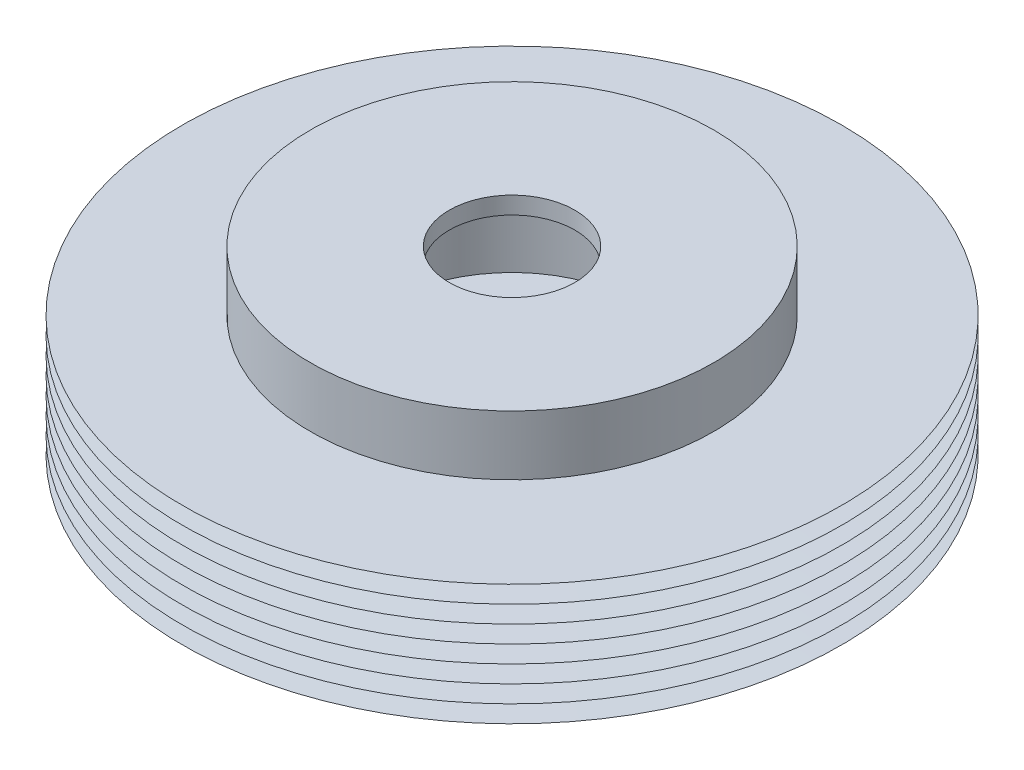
ISO-10303-21;
HEADER;
FILE_DESCRIPTION(('STEP AP214'),'2;1');
FILE_NAME('part.step','',(''),(''),'','','');
FILE_SCHEMA(('AUTOMOTIVE_DESIGN { 1 0 10303 214 1 1 1 1 }'));
ENDSEC;
DATA;
#1=APPLICATION_CONTEXT('core data for automotive mechanical design processes');
#2=APPLICATION_PROTOCOL_DEFINITION('international standard','automotive_design',2000,#1);
#3=PRODUCT_CONTEXT('',#1,'mechanical');
#4=PRODUCT('Part','Part','',(#3));
#5=PRODUCT_RELATED_PRODUCT_CATEGORY('part','',(#4));
#6=PRODUCT_DEFINITION_FORMATION('','',#4);
#7=PRODUCT_DEFINITION_CONTEXT('part definition',#1,'design');
#8=PRODUCT_DEFINITION('design','',#6,#7);
#9=PRODUCT_DEFINITION_SHAPE('','',#8);
#10=(LENGTH_UNIT() NAMED_UNIT(*) SI_UNIT(.MILLI.,.METRE.));
#11=(NAMED_UNIT(*) PLANE_ANGLE_UNIT() SI_UNIT($,.RADIAN.));
#12=(NAMED_UNIT(*) SI_UNIT($,.STERADIAN.) SOLID_ANGLE_UNIT());
#13=UNCERTAINTY_MEASURE_WITH_UNIT(LENGTH_MEASURE(1.E-05),#10,'distance_accuracy_value','');
#14=(GEOMETRIC_REPRESENTATION_CONTEXT(3) GLOBAL_UNCERTAINTY_ASSIGNED_CONTEXT((#13)) GLOBAL_UNIT_ASSIGNED_CONTEXT((#10,
#11,#12)) REPRESENTATION_CONTEXT('',''));
#15=CARTESIAN_POINT('',(0.,0.,0.));
#16=DIRECTION('',(0.,0.,1.));
#17=DIRECTION('',(1.,0.,0.));
#18=AXIS2_PLACEMENT_3D('',#15,#16,#17);
#19=CARTESIAN_POINT('',(8.,4.4,0.));
#20=DIRECTION('',(0.,1.,0.));
#21=DIRECTION('',(1.,0.,0.));
#22=AXIS2_PLACEMENT_3D('',#19,#20,#21);
#23=PLANE('',#22);
#24=CARTESIAN_POINT('',(0.,4.4,0.));
#25=DIRECTION('',(0.,-1.,0.));
#26=DIRECTION('',(0.,0.,-1.));
#27=AXIS2_PLACEMENT_3D('',#24,#25,#26);
#28=CIRCLE('',#27,4.);
#29=CARTESIAN_POINT('',(0.,4.4,-4.));
#30=VERTEX_POINT('',#29);
#31=EDGE_CURVE('E11',#30,#30,#28,.T.);
#32=ORIENTED_EDGE('',*,*,#31,.T.);
#33=EDGE_LOOP('',(#32));
#34=FACE_BOUND('',#33,.T.);
#35=CARTESIAN_POINT('',(0.,4.4,0.));
#36=DIRECTION('',(0.,-1.,0.));
#37=DIRECTION('',(0.,0.,-1.));
#38=AXIS2_PLACEMENT_3D('',#35,#36,#37);
#39=CIRCLE('',#38,8.);
#40=CARTESIAN_POINT('',(0.,4.4,-8.));
#41=VERTEX_POINT('',#40);
#42=EDGE_CURVE('E20',#41,#41,#39,.T.);
#43=ORIENTED_EDGE('',*,*,#42,.F.);
#44=EDGE_LOOP('',(#43));
#45=FACE_BOUND('',#44,.T.);
#46=ADVANCED_FACE('F16',(#34,#45),#23,.T.);
#47=CARTESIAN_POINT('',(0.,0.,0.));
#48=DIRECTION('',(0.,-1.,0.));
#49=DIRECTION('',(0.,0.,-1.));
#50=AXIS2_PLACEMENT_3D('',#47,#48,#49);
#51=CYLINDRICAL_SURFACE('',#50,4.);
#52=CARTESIAN_POINT('',(0.,0.,0.));
#53=DIRECTION('',(0.,-1.,0.));
#54=DIRECTION('',(0.,0.,-1.));
#55=AXIS2_PLACEMENT_3D('',#52,#53,#54);
#56=CIRCLE('',#55,4.);
#57=CARTESIAN_POINT('',(0.,0.,-4.));
#58=VERTEX_POINT('',#57);
#59=EDGE_CURVE('E27',#58,#58,#56,.T.);
#60=ORIENTED_EDGE('',*,*,#59,.T.);
#61=EDGE_LOOP('',(#60));
#62=FACE_BOUND('',#61,.T.);
#63=ORIENTED_EDGE('',*,*,#31,.F.);
#64=EDGE_LOOP('',(#63));
#65=FACE_BOUND('',#64,.T.);
#66=ADVANCED_FACE('F244',(#62,#65),#51,.F.);
#67=CARTESIAN_POINT('',(4.,0.,0.));
#68=DIRECTION('',(0.,-1.,0.));
#69=DIRECTION('',(0.,0.,-1.));
#70=AXIS2_PLACEMENT_3D('',#67,#68,#69);
#71=PLANE('',#70);
#72=CARTESIAN_POINT('',(0.,0.,0.));
#73=DIRECTION('',(0.,-1.,0.));
#74=DIRECTION('',(0.,0.,-1.));
#75=AXIS2_PLACEMENT_3D('',#72,#73,#74);
#76=CIRCLE('',#75,21.);
#77=CARTESIAN_POINT('',(0.,0.,-21.));
#78=VERTEX_POINT('',#77);
#79=EDGE_CURVE('E88',#78,#78,#76,.T.);
#80=ORIENTED_EDGE('',*,*,#79,.T.);
#81=EDGE_LOOP('',(#80));
#82=FACE_BOUND('',#81,.T.);
#83=ORIENTED_EDGE('',*,*,#59,.F.);
#84=EDGE_LOOP('',(#83));
#85=FACE_BOUND('',#84,.T.);
#86=ADVANCED_FACE('F250',(#82,#85),#71,.T.);
#87=CARTESIAN_POINT('',(0.,0.,0.));
#88=DIRECTION('',(0.,-1.,0.));
#89=DIRECTION('',(0.,0.,-1.));
#90=AXIS2_PLACEMENT_3D('',#87,#88,#89);
#91=CONICAL_SURFACE('',#90,21.,1.52682468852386);
#92=CARTESIAN_POINT('',(0.,0.55,0.));
#93=DIRECTION('',(0.,-1.,0.));
#94=DIRECTION('',(0.,0.,-1.));
#95=AXIS2_PLACEMENT_3D('',#92,#93,#94);
#96=CIRCLE('',#95,8.5);
#97=CARTESIAN_POINT('',(0.,0.55,-8.5));
#98=VERTEX_POINT('',#97);
#99=EDGE_CURVE('E160',#98,#98,#96,.T.);
#100=ORIENTED_EDGE('',*,*,#99,.T.);
#101=EDGE_LOOP('',(#100));
#102=FACE_BOUND('',#101,.T.);
#103=ORIENTED_EDGE('',*,*,#79,.F.);
#104=EDGE_LOOP('',(#103));
#105=FACE_BOUND('',#104,.T.);
#106=ADVANCED_FACE('F278',(#102,#105),#91,.T.);
#107=CARTESIAN_POINT('',(0.,0.55,0.));
#108=DIRECTION('',(0.,1.,0.));
#109=DIRECTION('',(0.,0.,1.));
#110=AXIS2_PLACEMENT_3D('',#107,#108,#109);
#111=CONICAL_SURFACE('',#110,8.5,1.52682468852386);
#112=CARTESIAN_POINT('',(0.,1.1,0.));
#113=DIRECTION('',(0.,-1.,0.));
#114=DIRECTION('',(0.,0.,-1.));
#115=AXIS2_PLACEMENT_3D('',#112,#113,#114);
#116=CIRCLE('',#115,21.);
#117=CARTESIAN_POINT('',(0.,1.1,-21.));
#118=VERTEX_POINT('',#117);
#119=EDGE_CURVE('E164',#118,#118,#116,.T.);
#120=ORIENTED_EDGE('',*,*,#119,.T.);
#121=EDGE_LOOP('',(#120));
#122=FACE_BOUND('',#121,.T.);
#123=ORIENTED_EDGE('',*,*,#99,.F.);
#124=EDGE_LOOP('',(#123));
#125=FACE_BOUND('',#124,.T.);
#126=ADVANCED_FACE('F283',(#122,#125),#111,.T.);
#127=CARTESIAN_POINT('',(0.,1.1,0.));
#128=DIRECTION('',(0.,-1.,0.));
#129=DIRECTION('',(0.,0.,-1.));
#130=AXIS2_PLACEMENT_3D('',#127,#128,#129);
#131=CONICAL_SURFACE('',#130,21.,1.52682468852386);
#132=CARTESIAN_POINT('',(0.,1.65,0.));
#133=DIRECTION('',(0.,-1.,0.));
#134=DIRECTION('',(0.,0.,-1.));
#135=AXIS2_PLACEMENT_3D('',#132,#133,#134);
#136=CIRCLE('',#135,8.5);
#137=CARTESIAN_POINT('',(0.,1.65,-8.5));
#138=VERTEX_POINT('',#137);
#139=EDGE_CURVE('E195',#138,#138,#136,.T.);
#140=ORIENTED_EDGE('',*,*,#139,.T.);
#141=EDGE_LOOP('',(#140));
#142=FACE_BOUND('',#141,.T.);
#143=ORIENTED_EDGE('',*,*,#119,.F.);
#144=EDGE_LOOP('',(#143));
#145=FACE_BOUND('',#144,.T.);
#146=ADVANCED_FACE('F285',(#142,#145),#131,.T.);
#147=CARTESIAN_POINT('',(0.,1.65,0.));
#148=DIRECTION('',(0.,1.,0.));
#149=DIRECTION('',(0.,0.,1.));
#150=AXIS2_PLACEMENT_3D('',#147,#148,#149);
#151=CONICAL_SURFACE('',#150,8.5,1.52682468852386);
#152=CARTESIAN_POINT('',(0.,2.2,0.));
#153=DIRECTION('',(0.,-1.,0.));
#154=DIRECTION('',(0.,0.,-1.));
#155=AXIS2_PLACEMENT_3D('',#152,#153,#154);
#156=CIRCLE('',#155,21.);
#157=CARTESIAN_POINT('',(0.,2.2,-21.));
#158=VERTEX_POINT('',#157);
#159=EDGE_CURVE('E107',#158,#158,#156,.T.);
#160=ORIENTED_EDGE('',*,*,#159,.T.);
#161=EDGE_LOOP('',(#160));
#162=FACE_BOUND('',#161,.T.);
#163=ORIENTED_EDGE('',*,*,#139,.F.);
#164=EDGE_LOOP('',(#163));
#165=FACE_BOUND('',#164,.T.);
#166=ADVANCED_FACE('F292',(#162,#165),#151,.T.);
#167=CARTESIAN_POINT('',(0.,2.2,0.));
#168=DIRECTION('',(0.,-1.,0.));
#169=DIRECTION('',(0.,0.,-1.));
#170=AXIS2_PLACEMENT_3D('',#167,#168,#169);
#171=CONICAL_SURFACE('',#170,21.,1.52682468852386);
#172=CARTESIAN_POINT('',(0.,2.75,0.));
#173=DIRECTION('',(0.,-1.,0.));
#174=DIRECTION('',(0.,0.,-1.));
#175=AXIS2_PLACEMENT_3D('',#172,#173,#174);
#176=CIRCLE('',#175,8.5);
#177=CARTESIAN_POINT('',(0.,2.75,-8.5));
#178=VERTEX_POINT('',#177);
#179=EDGE_CURVE('E116',#178,#178,#176,.T.);
#180=ORIENTED_EDGE('',*,*,#179,.T.);
#181=EDGE_LOOP('',(#180));
#182=FACE_BOUND('',#181,.T.);
#183=ORIENTED_EDGE('',*,*,#159,.F.);
#184=EDGE_LOOP('',(#183));
#185=FACE_BOUND('',#184,.T.);
#186=ADVANCED_FACE('F462',(#182,#185),#171,.T.);
#187=CARTESIAN_POINT('',(0.,2.75,0.));
#188=DIRECTION('',(0.,1.,0.));
#189=DIRECTION('',(0.,0.,1.));
#190=AXIS2_PLACEMENT_3D('',#187,#188,#189);
#191=CONICAL_SURFACE('',#190,8.5,1.52682468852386);
#192=CARTESIAN_POINT('',(0.,3.3,0.));
#193=DIRECTION('',(0.,-1.,0.));
#194=DIRECTION('',(0.,0.,-1.));
#195=AXIS2_PLACEMENT_3D('',#192,#193,#194);
#196=CIRCLE('',#195,21.);
#197=CARTESIAN_POINT('',(0.,3.3,-21.));
#198=VERTEX_POINT('',#197);
#199=EDGE_CURVE('E184',#198,#198,#196,.T.);
#200=ORIENTED_EDGE('',*,*,#199,.T.);
#201=EDGE_LOOP('',(#200));
#202=FACE_BOUND('',#201,.T.);
#203=ORIENTED_EDGE('',*,*,#179,.F.);
#204=EDGE_LOOP('',(#203));
#205=FACE_BOUND('',#204,.T.);
#206=ADVANCED_FACE('F458',(#202,#205),#191,.T.);
#207=CARTESIAN_POINT('',(0.,3.3,0.));
#208=DIRECTION('',(0.,-1.,0.));
#209=DIRECTION('',(0.,0.,-1.));
#210=AXIS2_PLACEMENT_3D('',#207,#208,#209);
#211=CONICAL_SURFACE('',#210,21.,1.52682468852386);
#212=CARTESIAN_POINT('',(0.,3.85,0.));
#213=DIRECTION('',(0.,-1.,0.));
#214=DIRECTION('',(0.,0.,-1.));
#215=AXIS2_PLACEMENT_3D('',#212,#213,#214);
#216=CIRCLE('',#215,8.5);
#217=CARTESIAN_POINT('',(0.,3.85,-8.5));
#218=VERTEX_POINT('',#217);
#219=EDGE_CURVE('E188',#218,#218,#216,.T.);
#220=ORIENTED_EDGE('',*,*,#219,.T.);
#221=EDGE_LOOP('',(#220));
#222=FACE_BOUND('',#221,.T.);
#223=ORIENTED_EDGE('',*,*,#199,.F.);
#224=EDGE_LOOP('',(#223));
#225=FACE_BOUND('',#224,.T.);
#226=ADVANCED_FACE('F450',(#222,#225),#211,.T.);
#227=CARTESIAN_POINT('',(0.,3.85,0.));
#228=DIRECTION('',(0.,1.,0.));
#229=DIRECTION('',(0.,0.,1.));
#230=AXIS2_PLACEMENT_3D('',#227,#228,#229);
#231=CONICAL_SURFACE('',#230,8.5,1.52682468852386);
#232=CARTESIAN_POINT('',(0.,4.4,0.));
#233=DIRECTION('',(0.,-1.,0.));
#234=DIRECTION('',(0.,0.,-1.));
#235=AXIS2_PLACEMENT_3D('',#232,#233,#234);
#236=CIRCLE('',#235,21.);
#237=CARTESIAN_POINT('',(0.,4.4,-21.));
#238=VERTEX_POINT('',#237);
#239=EDGE_CURVE('E198',#238,#238,#236,.T.);
#240=ORIENTED_EDGE('',*,*,#239,.T.);
#241=EDGE_LOOP('',(#240));
#242=FACE_BOUND('',#241,.T.);
#243=ORIENTED_EDGE('',*,*,#219,.F.);
#244=EDGE_LOOP('',(#243));
#245=FACE_BOUND('',#244,.T.);
#246=ADVANCED_FACE('F446',(#242,#245),#231,.T.);
#247=CARTESIAN_POINT('',(0.,4.4,0.));
#248=DIRECTION('',(0.,-1.,0.));
#249=DIRECTION('',(0.,0.,-1.));
#250=AXIS2_PLACEMENT_3D('',#247,#248,#249);
#251=CONICAL_SURFACE('',#250,21.,1.52682468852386);
#252=CARTESIAN_POINT('',(0.,4.95,0.));
#253=DIRECTION('',(0.,-1.,0.));
#254=DIRECTION('',(0.,0.,-1.));
#255=AXIS2_PLACEMENT_3D('',#252,#253,#254);
#256=CIRCLE('',#255,8.5);
#257=CARTESIAN_POINT('',(0.,4.95,-8.5));
#258=VERTEX_POINT('',#257);
#259=EDGE_CURVE('E178',#258,#258,#256,.T.);
#260=ORIENTED_EDGE('',*,*,#259,.T.);
#261=EDGE_LOOP('',(#260));
#262=FACE_BOUND('',#261,.T.);
#263=ORIENTED_EDGE('',*,*,#239,.F.);
#264=EDGE_LOOP('',(#263));
#265=FACE_BOUND('',#264,.T.);
#266=ADVANCED_FACE('F281',(#262,#265),#251,.T.);
#267=CARTESIAN_POINT('',(0.,4.95,0.));
#268=DIRECTION('',(0.,1.,0.));
#269=DIRECTION('',(0.,0.,1.));
#270=AXIS2_PLACEMENT_3D('',#267,#268,#269);
#271=CONICAL_SURFACE('',#270,8.5,1.52682468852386);
#272=CARTESIAN_POINT('',(0.,5.5,0.));
#273=DIRECTION('',(0.,-1.,0.));
#274=DIRECTION('',(0.,0.,-1.));
#275=AXIS2_PLACEMENT_3D('',#272,#273,#274);
#276=CIRCLE('',#275,21.);
#277=CARTESIAN_POINT('',(0.,5.5,-21.));
#278=VERTEX_POINT('',#277);
#279=EDGE_CURVE('E132',#278,#278,#276,.T.);
#280=ORIENTED_EDGE('',*,*,#279,.T.);
#281=EDGE_LOOP('',(#280));
#282=FACE_BOUND('',#281,.T.);
#283=ORIENTED_EDGE('',*,*,#259,.F.);
#284=EDGE_LOOP('',(#283));
#285=FACE_BOUND('',#284,.T.);
#286=ADVANCED_FACE('F271',(#282,#285),#271,.T.);
#287=CARTESIAN_POINT('',(0.,5.5,0.));
#288=DIRECTION('',(0.,-1.,0.));
#289=DIRECTION('',(0.,0.,-1.));
#290=AXIS2_PLACEMENT_3D('',#287,#288,#289);
#291=CONICAL_SURFACE('',#290,21.,1.52682468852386);
#292=CARTESIAN_POINT('',(0.,6.05,0.));
#293=DIRECTION('',(0.,-1.,0.));
#294=DIRECTION('',(0.,0.,-1.));
#295=AXIS2_PLACEMENT_3D('',#292,#293,#294);
#296=CIRCLE('',#295,8.5);
#297=CARTESIAN_POINT('',(0.,6.05,-8.5));
#298=VERTEX_POINT('',#297);
#299=EDGE_CURVE('E139',#298,#298,#296,.T.);
#300=ORIENTED_EDGE('',*,*,#299,.T.);
#301=EDGE_LOOP('',(#300));
#302=FACE_BOUND('',#301,.T.);
#303=ORIENTED_EDGE('',*,*,#279,.F.);
#304=EDGE_LOOP('',(#303));
#305=FACE_BOUND('',#304,.T.);
#306=ADVANCED_FACE('F264',(#302,#305),#291,.T.);
#307=CARTESIAN_POINT('',(0.,6.05,0.));
#308=DIRECTION('',(0.,1.,0.));
#309=DIRECTION('',(0.,0.,1.));
#310=AXIS2_PLACEMENT_3D('',#307,#308,#309);
#311=CONICAL_SURFACE('',#310,8.5,1.52682468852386);
#312=CARTESIAN_POINT('',(0.,6.6,0.));
#313=DIRECTION('',(0.,-1.,0.));
#314=DIRECTION('',(0.,0.,-1.));
#315=AXIS2_PLACEMENT_3D('',#312,#313,#314);
#316=CIRCLE('',#315,21.);
#317=CARTESIAN_POINT('',(0.,6.6,-21.));
#318=VERTEX_POINT('',#317);
#319=EDGE_CURVE('E144',#318,#318,#316,.T.);
#320=ORIENTED_EDGE('',*,*,#319,.T.);
#321=EDGE_LOOP('',(#320));
#322=FACE_BOUND('',#321,.T.);
#323=ORIENTED_EDGE('',*,*,#299,.F.);
#324=EDGE_LOOP('',(#323));
#325=FACE_BOUND('',#324,.T.);
#326=ADVANCED_FACE('F255',(#322,#325),#311,.T.);
#327=CARTESIAN_POINT('',(0.,6.6,0.));
#328=DIRECTION('',(0.,-1.,0.));
#329=DIRECTION('',(0.,0.,-1.));
#330=AXIS2_PLACEMENT_3D('',#327,#328,#329);
#331=CONICAL_SURFACE('',#330,21.,1.52682468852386);
#332=CARTESIAN_POINT('',(0.,7.15,0.));
#333=DIRECTION('',(0.,-1.,0.));
#334=DIRECTION('',(0.,0.,-1.));
#335=AXIS2_PLACEMENT_3D('',#332,#333,#334);
#336=CIRCLE('',#335,8.5);
#337=CARTESIAN_POINT('',(0.,7.15,-8.5));
#338=VERTEX_POINT('',#337);
#339=EDGE_CURVE('E148',#338,#338,#336,.T.);
#340=ORIENTED_EDGE('',*,*,#339,.T.);
#341=EDGE_LOOP('',(#340));
#342=FACE_BOUND('',#341,.T.);
#343=ORIENTED_EDGE('',*,*,#319,.F.);
#344=EDGE_LOOP('',(#343));
#345=FACE_BOUND('',#344,.T.);
#346=ADVANCED_FACE('F145',(#342,#345),#331,.T.);
#347=CARTESIAN_POINT('',(0.,7.15,0.));
#348=DIRECTION('',(0.,1.,0.));
#349=DIRECTION('',(0.,0.,1.));
#350=AXIS2_PLACEMENT_3D('',#347,#348,#349);
#351=CONICAL_SURFACE('',#350,8.5,1.52682468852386);
#352=CARTESIAN_POINT('',(0.,7.7,0.));
#353=DIRECTION('',(0.,-1.,0.));
#354=DIRECTION('',(0.,0.,-1.));
#355=AXIS2_PLACEMENT_3D('',#352,#353,#354);
#356=CIRCLE('',#355,21.);
#357=CARTESIAN_POINT('',(0.,7.7,-21.));
#358=VERTEX_POINT('',#357);
#359=EDGE_CURVE('E157',#358,#358,#356,.T.);
#360=ORIENTED_EDGE('',*,*,#359,.T.);
#361=EDGE_LOOP('',(#360));
#362=FACE_BOUND('',#361,.T.);
#363=ORIENTED_EDGE('',*,*,#339,.F.);
#364=EDGE_LOOP('',(#363));
#365=FACE_BOUND('',#364,.T.);
#366=ADVANCED_FACE('F239',(#362,#365),#351,.T.);
#367=CARTESIAN_POINT('',(21.,7.7,0.));
#368=DIRECTION('',(0.,1.,0.));
#369=DIRECTION('',(1.,0.,0.));
#370=AXIS2_PLACEMENT_3D('',#367,#368,#369);
#371=PLANE('',#370);
#372=CARTESIAN_POINT('',(0.,7.7,0.));
#373=DIRECTION('',(0.,-1.,0.));
#374=DIRECTION('',(0.,0.,-1.));
#375=AXIS2_PLACEMENT_3D('',#372,#373,#374);
#376=CIRCLE('',#375,12.85);
#377=CARTESIAN_POINT('',(0.,7.7,-12.85));
#378=VERTEX_POINT('',#377);
#379=EDGE_CURVE('E167',#378,#378,#376,.T.);
#380=ORIENTED_EDGE('',*,*,#379,.T.);
#381=EDGE_LOOP('',(#380));
#382=FACE_BOUND('',#381,.T.);
#383=ORIENTED_EDGE('',*,*,#359,.F.);
#384=EDGE_LOOP('',(#383));
#385=FACE_BOUND('',#384,.T.);
#386=ADVANCED_FACE('F222',(#382,#385),#371,.T.);
#387=CARTESIAN_POINT('',(0.,0.,0.));
#388=DIRECTION('',(0.,-1.,0.));
#389=DIRECTION('',(0.,0.,-1.));
#390=AXIS2_PLACEMENT_3D('',#387,#388,#389);
#391=CYLINDRICAL_SURFACE('',#390,12.85);
#392=CARTESIAN_POINT('',(0.,11.5,0.));
#393=DIRECTION('',(0.,-1.,0.));
#394=DIRECTION('',(0.,0.,-1.));
#395=AXIS2_PLACEMENT_3D('',#392,#393,#394);
#396=CIRCLE('',#395,12.85);
#397=CARTESIAN_POINT('',(0.,11.5,-12.85));
#398=VERTEX_POINT('',#397);
#399=EDGE_CURVE('E180',#398,#398,#396,.T.);
#400=ORIENTED_EDGE('',*,*,#399,.T.);
#401=EDGE_LOOP('',(#400));
#402=FACE_BOUND('',#401,.T.);
#403=ORIENTED_EDGE('',*,*,#379,.F.);
#404=EDGE_LOOP('',(#403));
#405=FACE_BOUND('',#404,.T.);
#406=ADVANCED_FACE('F225',(#402,#405),#391,.T.);
#407=CARTESIAN_POINT('',(12.85,11.5,0.));
#408=DIRECTION('',(0.,1.,0.));
#409=DIRECTION('',(1.,0.,0.));
#410=AXIS2_PLACEMENT_3D('',#407,#408,#409);
#411=PLANE('',#410);
#412=CARTESIAN_POINT('',(0.,11.5,0.));
#413=DIRECTION('',(0.,-1.,0.));
#414=DIRECTION('',(0.,0.,-1.));
#415=AXIS2_PLACEMENT_3D('',#412,#413,#414);
#416=CIRCLE('',#415,4.);
#417=CARTESIAN_POINT('',(0.,11.5,-4.));
#418=VERTEX_POINT('',#417);
#419=EDGE_CURVE('E173',#418,#418,#416,.T.);
#420=ORIENTED_EDGE('',*,*,#419,.T.);
#421=EDGE_LOOP('',(#420));
#422=FACE_BOUND('',#421,.T.);
#423=ORIENTED_EDGE('',*,*,#399,.F.);
#424=EDGE_LOOP('',(#423));
#425=FACE_BOUND('',#424,.T.);
#426=ADVANCED_FACE('F227',(#422,#425),#411,.T.);
#427=CARTESIAN_POINT('',(0.,0.,0.));
#428=DIRECTION('',(0.,-1.,0.));
#429=DIRECTION('',(0.,0.,-1.));
#430=AXIS2_PLACEMENT_3D('',#427,#428,#429);
#431=CYLINDRICAL_SURFACE('',#430,4.);
#432=CARTESIAN_POINT('',(0.,10.4,0.));
#433=DIRECTION('',(0.,-1.,0.));
#434=DIRECTION('',(0.,0.,-1.));
#435=AXIS2_PLACEMENT_3D('',#432,#433,#434);
#436=CIRCLE('',#435,4.);
#437=CARTESIAN_POINT('',(0.,10.4,-4.));
#438=VERTEX_POINT('',#437);
#439=EDGE_CURVE('E169',#438,#438,#436,.T.);
#440=ORIENTED_EDGE('',*,*,#439,.T.);
#441=EDGE_LOOP('',(#440));
#442=FACE_BOUND('',#441,.T.);
#443=ORIENTED_EDGE('',*,*,#419,.F.);
#444=EDGE_LOOP('',(#443));
#445=FACE_BOUND('',#444,.T.);
#446=ADVANCED_FACE('F236',(#442,#445),#431,.F.);
#447=CARTESIAN_POINT('',(4.,10.4,0.));
#448=DIRECTION('',(0.,-1.,0.));
#449=DIRECTION('',(0.,0.,-1.));
#450=AXIS2_PLACEMENT_3D('',#447,#448,#449);
#451=PLANE('',#450);
#452=CARTESIAN_POINT('',(0.,10.4,0.));
#453=DIRECTION('',(0.,-1.,0.));
#454=DIRECTION('',(0.,0.,-1.));
#455=AXIS2_PLACEMENT_3D('',#452,#453,#454);
#456=CIRCLE('',#455,8.);
#457=CARTESIAN_POINT('',(0.,10.4,-8.));
#458=VERTEX_POINT('',#457);
#459=EDGE_CURVE('E174',#458,#458,#456,.T.);
#460=ORIENTED_EDGE('',*,*,#459,.T.);
#461=EDGE_LOOP('',(#460));
#462=FACE_BOUND('',#461,.T.);
#463=ORIENTED_EDGE('',*,*,#439,.F.);
#464=EDGE_LOOP('',(#463));
#465=FACE_BOUND('',#464,.T.);
#466=ADVANCED_FACE('F18',(#462,#465),#451,.T.);
#467=CARTESIAN_POINT('',(0.,0.,0.));
#468=DIRECTION('',(0.,-1.,0.));
#469=DIRECTION('',(0.,0.,-1.));
#470=AXIS2_PLACEMENT_3D('',#467,#468,#469);
#471=CYLINDRICAL_SURFACE('',#470,8.);
#472=ORIENTED_EDGE('',*,*,#42,.T.);
#473=EDGE_LOOP('',(#472));
#474=FACE_BOUND('',#473,.T.);
#475=ORIENTED_EDGE('',*,*,#459,.F.);
#476=EDGE_LOOP('',(#475));
#477=FACE_BOUND('',#476,.T.);
#478=ADVANCED_FACE('F304',(#474,#477),#471,.F.);
#479=CLOSED_SHELL('',(#46,#66,#86,#106,#126,#146,#166,#186,#206,#226,#246,#266,#286,#306,#326,
#346,#366,#386,#406,#426,#446,#466,#478));
#480=MANIFOLD_SOLID_BREP('B1',#479);
#481=ADVANCED_BREP_SHAPE_REPRESENTATION('',(#18,#480),#14);
#482=SHAPE_DEFINITION_REPRESENTATION(#9,#481);
ENDSEC;
END-ISO-10303-21;
